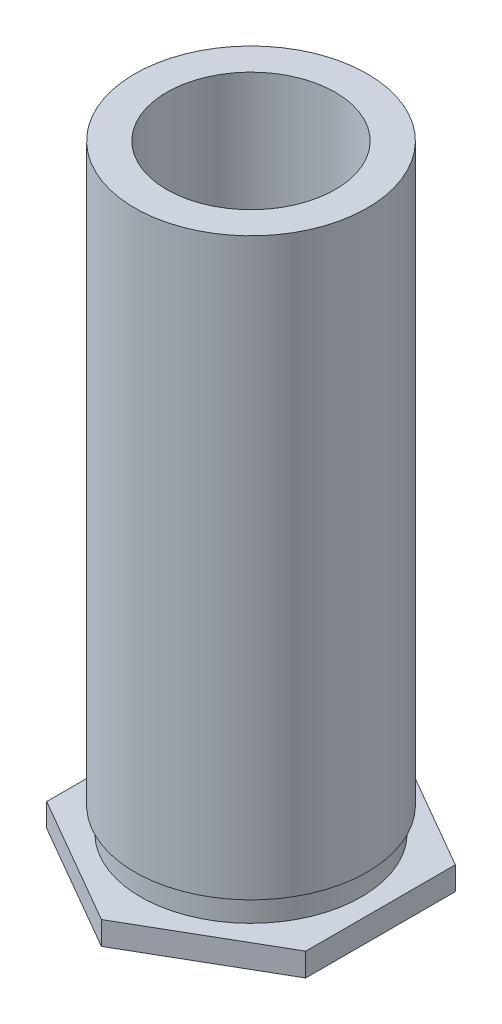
ISO-10303-21;
HEADER;
FILE_DESCRIPTION(('STEP AP214'),'2;1');
FILE_NAME('part.step','',(''),(''),'','','');
FILE_SCHEMA(('AUTOMOTIVE_DESIGN { 1 0 10303 214 1 1 1 1 }'));
ENDSEC;
DATA;
#1=APPLICATION_CONTEXT('core data for automotive mechanical design processes');
#2=APPLICATION_PROTOCOL_DEFINITION('international standard','automotive_design',2000,#1);
#3=PRODUCT_CONTEXT('',#1,'mechanical');
#4=PRODUCT('Part','Part','',(#3));
#5=PRODUCT_RELATED_PRODUCT_CATEGORY('part','',(#4));
#6=PRODUCT_DEFINITION_FORMATION('','',#4);
#7=PRODUCT_DEFINITION_CONTEXT('part definition',#1,'design');
#8=PRODUCT_DEFINITION('design','',#6,#7);
#9=PRODUCT_DEFINITION_SHAPE('','',#8);
#10=(LENGTH_UNIT() NAMED_UNIT(*) SI_UNIT(.MILLI.,.METRE.));
#11=(NAMED_UNIT(*) PLANE_ANGLE_UNIT() SI_UNIT($,.RADIAN.));
#12=(NAMED_UNIT(*) SI_UNIT($,.STERADIAN.) SOLID_ANGLE_UNIT());
#13=UNCERTAINTY_MEASURE_WITH_UNIT(LENGTH_MEASURE(1.E-05),#10,'distance_accuracy_value','');
#14=(GEOMETRIC_REPRESENTATION_CONTEXT(3) GLOBAL_UNCERTAINTY_ASSIGNED_CONTEXT((#13)) GLOBAL_UNIT_ASSIGNED_CONTEXT((#10,
#11,#12)) REPRESENTATION_CONTEXT('',''));
#15=CARTESIAN_POINT('',(0.,0.,0.));
#16=DIRECTION('',(0.,0.,1.));
#17=DIRECTION('',(1.,0.,0.));
#18=AXIS2_PLACEMENT_3D('',#15,#16,#17);
#19=CARTESIAN_POINT('',(4.596384,0.7112,0.));
#20=DIRECTION('',(0.,1.,0.));
#21=DIRECTION('',(0.,0.,1.));
#22=AXIS2_PLACEMENT_3D('',#19,#20,#21);
#23=PLANE('',#22);
#24=CARTESIAN_POINT('',(0.,0.711199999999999,0.));
#25=DIRECTION('',(0.,-1.,0.));
#26=DIRECTION('',(0.,0.,-1.));
#27=AXIS2_PLACEMENT_3D('',#24,#25,#26);
#28=CIRCLE('',#27,3.3782);
#29=CARTESIAN_POINT('',(0.,0.711199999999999,-3.3782));
#30=VERTEX_POINT('',#29);
#31=EDGE_CURVE('E11',#30,#30,#28,.T.);
#32=ORIENTED_EDGE('',*,*,#31,.T.);
#33=EDGE_LOOP('',(#32));
#34=FACE_BOUND('',#33,.T.);
#35=DIRECTION('',(0.866025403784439,0.,0.5));
#36=VECTOR('',#35,1.);
#37=CARTESIAN_POINT('',(0.,0.7112,4.57538541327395));
#38=LINE('',#37,#36);
#39=CARTESIAN_POINT('',(-3.9624,0.7112,2.28769270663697));
#40=VERTEX_POINT('',#39);
#41=CARTESIAN_POINT('',(0.,0.7112,4.57538541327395));
#42=VERTEX_POINT('',#41);
#43=EDGE_CURVE('E135',#40,#42,#38,.T.);
#44=ORIENTED_EDGE('',*,*,#43,.T.);
#45=DIRECTION('',(0.866025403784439,0.,-0.5));
#46=VECTOR('',#45,1.);
#47=CARTESIAN_POINT('',(3.9624,0.7112,2.28769270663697));
#48=LINE('',#47,#46);
#49=CARTESIAN_POINT('',(3.9624,0.7112,2.28769270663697));
#50=VERTEX_POINT('',#49);
#51=EDGE_CURVE('E124',#42,#50,#48,.T.);
#52=ORIENTED_EDGE('',*,*,#51,.T.);
#53=DIRECTION('',(0.,0.,-1.));
#54=VECTOR('',#53,1.);
#55=CARTESIAN_POINT('',(3.9624,0.7112,-2.28769270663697));
#56=LINE('',#55,#54);
#57=CARTESIAN_POINT('',(3.9624,0.7112,-2.28769270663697));
#58=VERTEX_POINT('',#57);
#59=EDGE_CURVE('E127',#50,#58,#56,.T.);
#60=ORIENTED_EDGE('',*,*,#59,.T.);
#61=DIRECTION('',(-0.866025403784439,0.,-0.5));
#62=VECTOR('',#61,1.);
#63=CARTESIAN_POINT('',(0.,0.7112,-4.57538541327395));
#64=LINE('',#63,#62);
#65=CARTESIAN_POINT('',(0.,0.7112,-4.57538541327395));
#66=VERTEX_POINT('',#65);
#67=EDGE_CURVE('E55',#58,#66,#64,.T.);
#68=ORIENTED_EDGE('',*,*,#67,.T.);
#69=DIRECTION('',(-0.866025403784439,0.,0.5));
#70=VECTOR('',#69,1.);
#71=CARTESIAN_POINT('',(-3.9624,0.7112,-2.28769270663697));
#72=LINE('',#71,#70);
#73=CARTESIAN_POINT('',(-3.9624,0.7112,-2.28769270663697));
#74=VERTEX_POINT('',#73);
#75=EDGE_CURVE('E100',#66,#74,#72,.T.);
#76=ORIENTED_EDGE('',*,*,#75,.T.);
#77=DIRECTION('',(0.,0.,1.));
#78=VECTOR('',#77,1.);
#79=CARTESIAN_POINT('',(-3.9624,0.7112,2.28769270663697));
#80=LINE('',#79,#78);
#81=EDGE_CURVE('E132',#74,#40,#80,.T.);
#82=ORIENTED_EDGE('',*,*,#81,.T.);
#83=EDGE_LOOP('',(#44,#52,#60,#68,#76,#82));
#84=FACE_BOUND('',#83,.T.);
#85=ADVANCED_FACE('F39',(#34,#84),#23,.T.);
#86=CARTESIAN_POINT('',(3.556,0.,0.));
#87=DIRECTION('',(0.,-1.,0.));
#88=DIRECTION('',(0.,0.,-1.));
#89=AXIS2_PLACEMENT_3D('',#86,#87,#88);
#90=PLANE('',#89);
#91=CARTESIAN_POINT('',(0.,0.,0.));
#92=DIRECTION('',(0.,-1.,0.));
#93=DIRECTION('',(0.,0.,-1.));
#94=AXIS2_PLACEMENT_3D('',#91,#92,#93);
#95=CIRCLE('',#94,3.556);
#96=CARTESIAN_POINT('',(0.,0.,-3.556));
#97=VERTEX_POINT('',#96);
#98=EDGE_CURVE('E154',#97,#97,#95,.T.);
#99=ORIENTED_EDGE('',*,*,#98,.F.);
#100=EDGE_LOOP('',(#99));
#101=FACE_BOUND('',#100,.T.);
#102=DIRECTION('',(0.,0.,-1.));
#103=VECTOR('',#102,1.);
#104=CARTESIAN_POINT('',(3.9624,0.,-2.28769270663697));
#105=LINE('',#104,#103);
#106=CARTESIAN_POINT('',(3.9624,0.,2.28769270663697));
#107=VERTEX_POINT('',#106);
#108=CARTESIAN_POINT('',(3.9624,0.,-2.28769270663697));
#109=VERTEX_POINT('',#108);
#110=EDGE_CURVE('E110',#107,#109,#105,.T.);
#111=ORIENTED_EDGE('',*,*,#110,.F.);
#112=DIRECTION('',(0.866025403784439,0.,-0.5));
#113=VECTOR('',#112,1.);
#114=CARTESIAN_POINT('',(3.9624,0.,2.28769270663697));
#115=LINE('',#114,#113);
#116=CARTESIAN_POINT('',(0.,0.,4.57538541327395));
#117=VERTEX_POINT('',#116);
#118=EDGE_CURVE('E63',#117,#107,#115,.T.);
#119=ORIENTED_EDGE('',*,*,#118,.F.);
#120=DIRECTION('',(0.866025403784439,0.,0.5));
#121=VECTOR('',#120,1.);
#122=CARTESIAN_POINT('',(0.,0.,4.57538541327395));
#123=LINE('',#122,#121);
#124=CARTESIAN_POINT('',(-3.9624,0.,2.28769270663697));
#125=VERTEX_POINT('',#124);
#126=EDGE_CURVE('E117',#125,#117,#123,.T.);
#127=ORIENTED_EDGE('',*,*,#126,.F.);
#128=DIRECTION('',(0.,0.,1.));
#129=VECTOR('',#128,1.);
#130=CARTESIAN_POINT('',(-3.9624,0.,2.28769270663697));
#131=LINE('',#130,#129);
#132=CARTESIAN_POINT('',(-3.9624,0.,-2.28769270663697));
#133=VERTEX_POINT('',#132);
#134=EDGE_CURVE('E115',#133,#125,#131,.T.);
#135=ORIENTED_EDGE('',*,*,#134,.F.);
#136=DIRECTION('',(-0.866025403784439,0.,0.5));
#137=VECTOR('',#136,1.);
#138=CARTESIAN_POINT('',(-3.9624,0.,-2.28769270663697));
#139=LINE('',#138,#137);
#140=CARTESIAN_POINT('',(0.,0.,-4.57538541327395));
#141=VERTEX_POINT('',#140);
#142=EDGE_CURVE('E97',#141,#133,#139,.T.);
#143=ORIENTED_EDGE('',*,*,#142,.F.);
#144=DIRECTION('',(-0.866025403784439,0.,-0.5));
#145=VECTOR('',#144,1.);
#146=CARTESIAN_POINT('',(0.,0.,-4.57538541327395));
#147=LINE('',#146,#145);
#148=EDGE_CURVE('E105',#109,#141,#147,.T.);
#149=ORIENTED_EDGE('',*,*,#148,.F.);
#150=EDGE_LOOP('',(#111,#119,#127,#135,#143,#149));
#151=FACE_BOUND('',#150,.T.);
#152=ADVANCED_FACE('F112',(#101,#151),#90,.T.);
#153=CARTESIAN_POINT('',(0.,0.,0.));
#154=DIRECTION('',(0.,-1.,0.));
#155=DIRECTION('',(0.,0.,-1.));
#156=AXIS2_PLACEMENT_3D('',#153,#154,#155);
#157=CYLINDRICAL_SURFACE('',#156,3.3782);
#158=CARTESIAN_POINT('',(0.,1.45796,0.));
#159=DIRECTION('',(0.,-1.,0.));
#160=DIRECTION('',(0.,0.,-1.));
#161=AXIS2_PLACEMENT_3D('',#158,#159,#160);
#162=CIRCLE('',#161,3.3782);
#163=CARTESIAN_POINT('',(0.,1.45796,-3.3782));
#164=VERTEX_POINT('',#163);
#165=EDGE_CURVE('E47',#164,#164,#162,.T.);
#166=ORIENTED_EDGE('',*,*,#165,.T.);
#167=EDGE_LOOP('',(#166));
#168=FACE_BOUND('',#167,.T.);
#169=ORIENTED_EDGE('',*,*,#31,.F.);
#170=EDGE_LOOP('',(#169));
#171=FACE_BOUND('',#170,.T.);
#172=ADVANCED_FACE('F193',(#168,#171),#157,.T.);
#173=CARTESIAN_POINT('',(3.556,1.45796,0.));
#174=DIRECTION('',(0.,-1.,0.));
#175=DIRECTION('',(0.,0.,-1.));
#176=AXIS2_PLACEMENT_3D('',#173,#174,#175);
#177=PLANE('',#176);
#178=CARTESIAN_POINT('',(0.,1.45796,0.));
#179=DIRECTION('',(0.,-1.,0.));
#180=DIRECTION('',(0.,0.,-1.));
#181=AXIS2_PLACEMENT_3D('',#178,#179,#180);
#182=CIRCLE('',#181,3.556);
#183=CARTESIAN_POINT('',(0.,1.45796,-3.556));
#184=VERTEX_POINT('',#183);
#185=EDGE_CURVE('E164',#184,#184,#182,.T.);
#186=ORIENTED_EDGE('',*,*,#185,.T.);
#187=EDGE_LOOP('',(#186));
#188=FACE_BOUND('',#187,.T.);
#189=ORIENTED_EDGE('',*,*,#165,.F.);
#190=EDGE_LOOP('',(#189));
#191=FACE_BOUND('',#190,.T.);
#192=ADVANCED_FACE('F187',(#188,#191),#177,.T.);
#193=CARTESIAN_POINT('',(0.,0.,0.));
#194=DIRECTION('',(0.,-1.,0.));
#195=DIRECTION('',(0.,0.,-1.));
#196=AXIS2_PLACEMENT_3D('',#193,#194,#195);
#197=CYLINDRICAL_SURFACE('',#196,3.556);
#198=CARTESIAN_POINT('',(0.,19.05,0.));
#199=DIRECTION('',(0.,-1.,0.));
#200=DIRECTION('',(0.,0.,-1.));
#201=AXIS2_PLACEMENT_3D('',#198,#199,#200);
#202=CIRCLE('',#201,3.556);
#203=CARTESIAN_POINT('',(0.,19.05,-3.556));
#204=VERTEX_POINT('',#203);
#205=EDGE_CURVE('E161',#204,#204,#202,.T.);
#206=ORIENTED_EDGE('',*,*,#205,.T.);
#207=EDGE_LOOP('',(#206));
#208=FACE_BOUND('',#207,.T.);
#209=ORIENTED_EDGE('',*,*,#185,.F.);
#210=EDGE_LOOP('',(#209));
#211=FACE_BOUND('',#210,.T.);
#212=ADVANCED_FACE('F181',(#208,#211),#197,.T.);
#213=CARTESIAN_POINT('',(3.556,19.05,0.));
#214=DIRECTION('',(0.,1.,0.));
#215=DIRECTION('',(0.,0.,1.));
#216=AXIS2_PLACEMENT_3D('',#213,#214,#215);
#217=PLANE('',#216);
#218=CARTESIAN_POINT('',(0.,19.05,0.));
#219=DIRECTION('',(0.,1.,0.));
#220=DIRECTION('',(0.,0.,1.));
#221=AXIS2_PLACEMENT_3D('',#218,#219,#220);
#222=CIRCLE('',#221,2.5781);
#223=CARTESIAN_POINT('',(0.,19.05,2.5781));
#224=VERTEX_POINT('',#223);
#225=EDGE_CURVE('E42',#224,#224,#222,.T.);
#226=ORIENTED_EDGE('',*,*,#225,.F.);
#227=EDGE_LOOP('',(#226));
#228=FACE_BOUND('',#227,.T.);
#229=ORIENTED_EDGE('',*,*,#205,.F.);
#230=EDGE_LOOP('',(#229));
#231=FACE_BOUND('',#230,.T.);
#232=ADVANCED_FACE('F177',(#228,#231),#217,.T.);
#233=CARTESIAN_POINT('',(0.,0.,0.));
#234=DIRECTION('',(0.,-1.,0.));
#235=DIRECTION('',(0.,0.,-1.));
#236=AXIS2_PLACEMENT_3D('',#233,#234,#235);
#237=CYLINDRICAL_SURFACE('',#236,1.94056);
#238=CARTESIAN_POINT('',(0.,10.7945168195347,0.));
#239=DIRECTION('',(0.,-1.,0.));
#240=DIRECTION('',(0.,0.,-1.));
#241=AXIS2_PLACEMENT_3D('',#238,#239,#240);
#242=CIRCLE('',#241,1.94056);
#243=CARTESIAN_POINT('',(0.,10.7945168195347,-1.94056));
#244=VERTEX_POINT('',#243);
#245=EDGE_CURVE('E148',#244,#244,#242,.T.);
#246=ORIENTED_EDGE('',*,*,#245,.F.);
#247=EDGE_LOOP('',(#246));
#248=FACE_BOUND('',#247,.T.);
#249=CARTESIAN_POINT('',(0.,0.00253999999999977,0.));
#250=DIRECTION('',(0.,-1.,0.));
#251=DIRECTION('',(0.,0.,-1.));
#252=AXIS2_PLACEMENT_3D('',#249,#250,#251);
#253=CIRCLE('',#252,1.94056);
#254=CARTESIAN_POINT('',(0.,0.00253999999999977,-1.94056));
#255=VERTEX_POINT('',#254);
#256=EDGE_CURVE('E158',#255,#255,#253,.T.);
#257=ORIENTED_EDGE('',*,*,#256,.T.);
#258=EDGE_LOOP('',(#257));
#259=FACE_BOUND('',#258,.T.);
#260=ADVANCED_FACE('F180',(#248,#259),#237,.F.);
#261=CARTESIAN_POINT('',(3.556,0.00253999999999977,0.));
#262=DIRECTION('',(0.,-1.,0.));
#263=DIRECTION('',(0.,0.,-1.));
#264=AXIS2_PLACEMENT_3D('',#261,#262,#263);
#265=PLANE('',#264);
#266=ORIENTED_EDGE('',*,*,#256,.F.);
#267=EDGE_LOOP('',(#266));
#268=FACE_BOUND('',#267,.T.);
#269=CARTESIAN_POINT('',(0.,0.00253999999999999,0.));
#270=DIRECTION('',(0.,-1.,0.));
#271=DIRECTION('',(0.,0.,-1.));
#272=AXIS2_PLACEMENT_3D('',#269,#270,#271);
#273=CIRCLE('',#272,3.556);
#274=CARTESIAN_POINT('',(0.,0.00253999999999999,-3.556));
#275=VERTEX_POINT('',#274);
#276=EDGE_CURVE('E157',#275,#275,#273,.T.);
#277=ORIENTED_EDGE('',*,*,#276,.T.);
#278=EDGE_LOOP('',(#277));
#279=FACE_BOUND('',#278,.T.);
#280=ADVANCED_FACE('F239',(#268,#279),#265,.T.);
#281=CARTESIAN_POINT('',(0.,0.,0.));
#282=DIRECTION('',(0.,-1.,0.));
#283=DIRECTION('',(0.,0.,-1.));
#284=AXIS2_PLACEMENT_3D('',#281,#282,#283);
#285=CYLINDRICAL_SURFACE('',#284,3.556);
#286=ORIENTED_EDGE('',*,*,#98,.T.);
#287=EDGE_LOOP('',(#286));
#288=FACE_BOUND('',#287,.T.);
#289=ORIENTED_EDGE('',*,*,#276,.F.);
#290=EDGE_LOOP('',(#289));
#291=FACE_BOUND('',#290,.T.);
#292=ADVANCED_FACE('F232',(#288,#291),#285,.F.);
#293=CARTESIAN_POINT('',(2.5781,11.1252,0.));
#294=DIRECTION('',(0.,-1.,0.));
#295=DIRECTION('',(0.,0.,-1.));
#296=AXIS2_PLACEMENT_3D('',#293,#294,#295);
#297=PLANE('',#296);
#298=CARTESIAN_POINT('',(0.,11.1252,0.));
#299=DIRECTION('',(0.,-1.,0.));
#300=DIRECTION('',(0.,0.,-1.));
#301=AXIS2_PLACEMENT_3D('',#298,#299,#300);
#302=CIRCLE('',#301,2.5781);
#303=CARTESIAN_POINT('',(0.,11.1252,-2.5781));
#304=VERTEX_POINT('',#303);
#305=EDGE_CURVE('E140',#304,#304,#302,.T.);
#306=ORIENTED_EDGE('',*,*,#305,.F.);
#307=EDGE_LOOP('',(#306));
#308=FACE_BOUND('',#307,.T.);
#309=CARTESIAN_POINT('',(0.,11.1252,0.));
#310=DIRECTION('',(0.,-1.,0.));
#311=DIRECTION('',(0.,0.,-1.));
#312=AXIS2_PLACEMENT_3D('',#309,#310,#311);
#313=CIRCLE('',#312,2.413);
#314=CARTESIAN_POINT('',(0.,11.1252,-2.413));
#315=VERTEX_POINT('',#314);
#316=EDGE_CURVE('E151',#315,#315,#313,.T.);
#317=ORIENTED_EDGE('',*,*,#316,.T.);
#318=EDGE_LOOP('',(#317));
#319=FACE_BOUND('',#318,.T.);
#320=ADVANCED_FACE('F228',(#308,#319),#297,.F.);
#321=CARTESIAN_POINT('',(0.,10.7945168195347,0.));
#322=DIRECTION('',(0.,1.,0.));
#323=DIRECTION('',(0.,0.,1.));
#324=AXIS2_PLACEMENT_3D('',#321,#322,#323);
#325=CONICAL_SURFACE('',#324,1.94056,0.960105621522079);
#326=ORIENTED_EDGE('',*,*,#316,.F.);
#327=EDGE_LOOP('',(#326));
#328=FACE_BOUND('',#327,.T.);
#329=ORIENTED_EDGE('',*,*,#245,.T.);
#330=EDGE_LOOP('',(#329));
#331=FACE_BOUND('',#330,.T.);
#332=ADVANCED_FACE('F225',(#328,#331),#325,.F.);
#333=CARTESIAN_POINT('',(0.,-2.54,0.));
#334=DIRECTION('',(0.,-1.,0.));
#335=DIRECTION('',(0.,0.,-1.));
#336=AXIS2_PLACEMENT_3D('',#333,#334,#335);
#337=CYLINDRICAL_SURFACE('',#336,2.5781);
#338=ORIENTED_EDGE('',*,*,#225,.T.);
#339=EDGE_LOOP('',(#338));
#340=FACE_BOUND('',#339,.T.);
#341=ORIENTED_EDGE('',*,*,#305,.T.);
#342=EDGE_LOOP('',(#341));
#343=FACE_BOUND('',#342,.T.);
#344=ADVANCED_FACE('F174',(#340,#343),#337,.F.);
#345=CARTESIAN_POINT('',(3.9624,0.,2.28769270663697));
#346=DIRECTION('',(0.5,0.,0.866025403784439));
#347=DIRECTION('',(0.866025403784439,0.,-0.5));
#348=AXIS2_PLACEMENT_3D('',#345,#346,#347);
#349=PLANE('',#348);
#350=ORIENTED_EDGE('',*,*,#51,.F.);
#351=DIRECTION('',(0.,1.,0.));
#352=VECTOR('',#351,1.);
#353=CARTESIAN_POINT('',(0.,0.,4.57538541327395));
#354=LINE('',#353,#352);
#355=EDGE_CURVE('E138',#117,#42,#354,.T.);
#356=ORIENTED_EDGE('',*,*,#355,.F.);
#357=ORIENTED_EDGE('',*,*,#118,.T.);
#358=DIRECTION('',(0.,1.,0.));
#359=VECTOR('',#358,1.);
#360=CARTESIAN_POINT('',(3.9624,0.,2.28769270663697));
#361=LINE('',#360,#359);
#362=EDGE_CURVE('E123',#107,#50,#361,.T.);
#363=ORIENTED_EDGE('',*,*,#362,.T.);
#364=EDGE_LOOP('',(#350,#356,#357,#363));
#365=FACE_BOUND('',#364,.T.);
#366=ADVANCED_FACE('F208',(#365),#349,.T.);
#367=CARTESIAN_POINT('',(0.,0.,4.57538541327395));
#368=DIRECTION('',(-0.5,0.,0.866025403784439));
#369=DIRECTION('',(0.866025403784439,0.,0.5));
#370=AXIS2_PLACEMENT_3D('',#367,#368,#369);
#371=PLANE('',#370);
#372=ORIENTED_EDGE('',*,*,#43,.F.);
#373=DIRECTION('',(0.,1.,0.));
#374=VECTOR('',#373,1.);
#375=CARTESIAN_POINT('',(-3.9624,0.,2.28769270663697));
#376=LINE('',#375,#374);
#377=EDGE_CURVE('E141',#125,#40,#376,.T.);
#378=ORIENTED_EDGE('',*,*,#377,.F.);
#379=ORIENTED_EDGE('',*,*,#126,.T.);
#380=ORIENTED_EDGE('',*,*,#355,.T.);
#381=EDGE_LOOP('',(#372,#378,#379,#380));
#382=FACE_BOUND('',#381,.T.);
#383=ADVANCED_FACE('F207',(#382),#371,.T.);
#384=CARTESIAN_POINT('',(-3.9624,0.,2.28769270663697));
#385=DIRECTION('',(-1.,0.,0.));
#386=DIRECTION('',(0.,0.,1.));
#387=AXIS2_PLACEMENT_3D('',#384,#385,#386);
#388=PLANE('',#387);
#389=ORIENTED_EDGE('',*,*,#81,.F.);
#390=DIRECTION('',(0.,1.,0.));
#391=VECTOR('',#390,1.);
#392=CARTESIAN_POINT('',(-3.9624,0.,-2.28769270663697));
#393=LINE('',#392,#391);
#394=EDGE_CURVE('E101',#133,#74,#393,.T.);
#395=ORIENTED_EDGE('',*,*,#394,.F.);
#396=ORIENTED_EDGE('',*,*,#134,.T.);
#397=ORIENTED_EDGE('',*,*,#377,.T.);
#398=EDGE_LOOP('',(#389,#395,#396,#397));
#399=FACE_BOUND('',#398,.T.);
#400=ADVANCED_FACE('F288',(#399),#388,.T.);
#401=CARTESIAN_POINT('',(-3.9624,0.,-2.28769270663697));
#402=DIRECTION('',(-0.5,0.,-0.866025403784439));
#403=DIRECTION('',(-0.866025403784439,0.,0.5));
#404=AXIS2_PLACEMENT_3D('',#401,#402,#403);
#405=PLANE('',#404);
#406=ORIENTED_EDGE('',*,*,#75,.F.);
#407=DIRECTION('',(0.,1.,0.));
#408=VECTOR('',#407,1.);
#409=CARTESIAN_POINT('',(0.,0.,-4.57538541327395));
#410=LINE('',#409,#408);
#411=EDGE_CURVE('E93',#141,#66,#410,.T.);
#412=ORIENTED_EDGE('',*,*,#411,.F.);
#413=ORIENTED_EDGE('',*,*,#142,.T.);
#414=ORIENTED_EDGE('',*,*,#394,.T.);
#415=EDGE_LOOP('',(#406,#412,#413,#414));
#416=FACE_BOUND('',#415,.T.);
#417=ADVANCED_FACE('F95',(#416),#405,.T.);
#418=CARTESIAN_POINT('',(0.,0.,-4.57538541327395));
#419=DIRECTION('',(0.5,0.,-0.866025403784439));
#420=DIRECTION('',(-0.866025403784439,0.,-0.5));
#421=AXIS2_PLACEMENT_3D('',#418,#419,#420);
#422=PLANE('',#421);
#423=ORIENTED_EDGE('',*,*,#67,.F.);
#424=DIRECTION('',(0.,1.,0.));
#425=VECTOR('',#424,1.);
#426=CARTESIAN_POINT('',(3.9624,0.,-2.28769270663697));
#427=LINE('',#426,#425);
#428=EDGE_CURVE('E102',#109,#58,#427,.T.);
#429=ORIENTED_EDGE('',*,*,#428,.F.);
#430=ORIENTED_EDGE('',*,*,#148,.T.);
#431=ORIENTED_EDGE('',*,*,#411,.T.);
#432=EDGE_LOOP('',(#423,#429,#430,#431));
#433=FACE_BOUND('',#432,.T.);
#434=ADVANCED_FACE('F106',(#433),#422,.T.);
#435=CARTESIAN_POINT('',(3.9624,0.,-2.28769270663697));
#436=DIRECTION('',(1.,0.,0.));
#437=DIRECTION('',(0.,0.,-1.));
#438=AXIS2_PLACEMENT_3D('',#435,#436,#437);
#439=PLANE('',#438);
#440=ORIENTED_EDGE('',*,*,#59,.F.);
#441=ORIENTED_EDGE('',*,*,#362,.F.);
#442=ORIENTED_EDGE('',*,*,#110,.T.);
#443=ORIENTED_EDGE('',*,*,#428,.T.);
#444=EDGE_LOOP('',(#440,#441,#442,#443));
#445=FACE_BOUND('',#444,.T.);
#446=ADVANCED_FACE('F211',(#445),#439,.T.);
#447=CLOSED_SHELL('',(#85,#152,#172,#192,#212,#232,#260,#280,#292,#320,#332,#344,#366,#383,#400,
#417,#434,#446));
#448=MANIFOLD_SOLID_BREP('B2',#447);
#449=ADVANCED_BREP_SHAPE_REPRESENTATION('',(#18,#448),#14);
#450=SHAPE_DEFINITION_REPRESENTATION(#9,#449);
ENDSEC;
END-ISO-10303-21;
